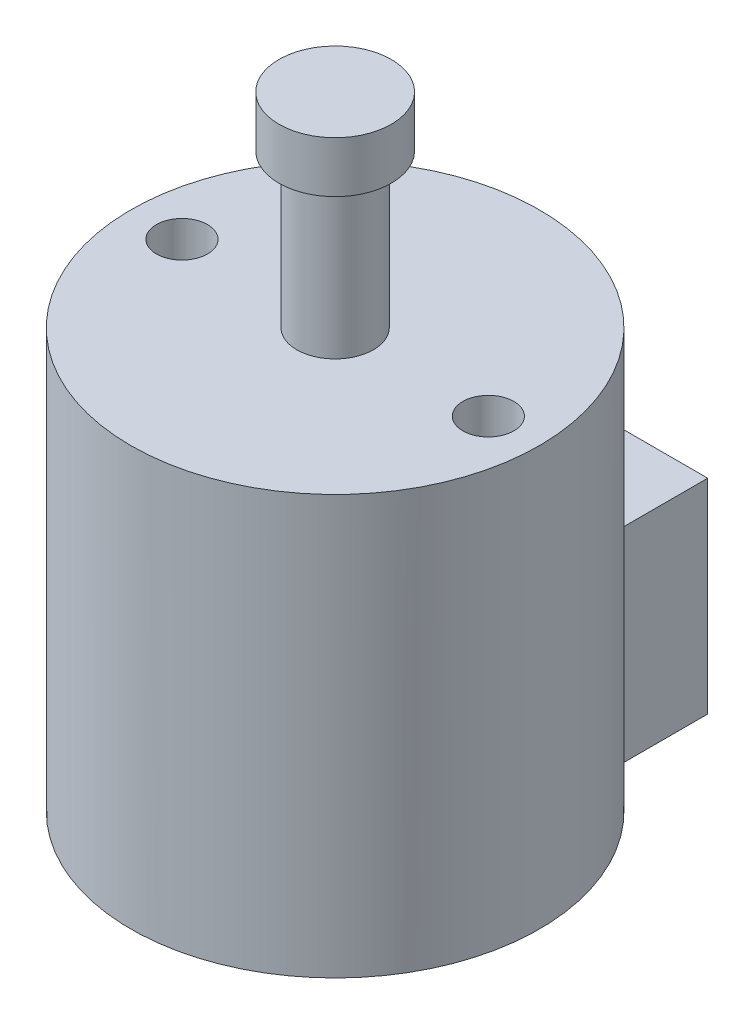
from build123d import *

# Parameters (mm, degrees)
SKETCH1_R           = 4
BOSS_EXTRUDE1_DEPTH = 8.2
SKETCH2_W           = 4
SKETCH2_H           = 5.296379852
BOSS_EXTRUDE2_DEPTH = 4
SKETCH3_W           = 0.665952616
SKETCH3_H           = 0.665952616
BOSS_EXTRUDE3_DEPTH = 0.254
FILLET1_R           = 0.2
SKETCH4_R           = 0.75
BOSS_EXTRUDE4_DEPTH = 4
SKETCH5_R           = 1.1
BOSS_EXTRUDE5_DEPTH = 1
SKETCH6_R           = 0.5
CUT_EXTRUDE1_DEPTH  = 2


with BuildPart() as part:
    # Sketch1 → Boss-Extrude1 (new body)
    with BuildSketch(Plane(origin=(0, 0, 0), x_dir=(1, 0, 0), z_dir=(0, 1, 0))):
        with Locations(Location((0, 0, 0), (0, 0, 270))):
            Circle(SKETCH1_R)
    extrude(amount=BOSS_EXTRUDE1_DEPTH)

    # Sketch2 → Boss-Extrude2 (add)
    with BuildSketch(Plane(origin=(0, 0, 0), x_dir=(1, 0, 0), z_dir=(0, 1, 0))):
        with Locations((0, 2.648189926)):
            Rectangle(SKETCH2_W, SKETCH2_H)
    extrude(amount=BOSS_EXTRUDE2_DEPTH)

    # Sketch3 → Boss-Extrude3 (add)
    with BuildSketch(Plane(origin=(0, 0, -5.296379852), x_dir=(-1, 0, 0), z_dir=(0, 0, -1))):
        with Locations((-0.507976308, 1.835206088)):
            Rectangle(SKETCH3_W, SKETCH3_H)
        with Locations((1.523928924, 1.835206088)):
            Rectangle(SKETCH3_W, SKETCH3_H)
        with Locations((0.507976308, 1.835206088)):
            Rectangle(SKETCH3_W, SKETCH3_H)
        with Locations((-1.523928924, 1.835206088)):
            Rectangle(SKETCH3_W, SKETCH3_H)
    extrude(amount=BOSS_EXTRUDE3_DEPTH)

    # Fillet1
    fillet1_edges = [part.edges().sort_by_distance(p)[0] for p in [
        (-1.856905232, 1.835206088, -5.550379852),
        (-1.523928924, 2.168182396, -5.550379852),
        (-1.190952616, 1.835206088, -5.550379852),
        (-1.523928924, 1.50222978, -5.550379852),
        (-0.840952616, 1.835206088, -5.550379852),
        (-0.507976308, 2.168182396, -5.550379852),
        (-0.175, 1.835206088, -5.550379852),
        (-0.507976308, 1.50222978, -5.550379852),
        (0.507976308, 2.168182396, -5.550379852),
        (0.840952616, 1.835206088, -5.550379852),
        (0.507976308, 1.50222978, -5.550379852),
        (0.175, 1.835206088, -5.550379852),
        (1.523928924, 2.168182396, -5.550379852),
        (1.856905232, 1.835206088, -5.550379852),
        (1.523928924, 1.50222978, -5.550379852),
        (1.190952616, 1.835206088, -5.550379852),
    ]]
    fillet(fillet1_edges, radius=FILLET1_R)

    # Sketch4 → Boss-Extrude4 (add)
    with BuildSketch(Plane(origin=(0, 8.2, 0), x_dir=(1, 0, 0), z_dir=(0, 1, 0))):
        with Locations(Location((0, 0, 0), (0, 0, 270))):
            Circle(SKETCH4_R)
    extrude(amount=BOSS_EXTRUDE4_DEPTH)

    # Sketch5 → Boss-Extrude5 (add)
    with BuildSketch(Plane(origin=(0, 12.2, 0), x_dir=(1, 0, 0), z_dir=(0, 1, 0))):
        with Locations(Location((0, 0, 0), (0, 0, 270))):
            Circle(SKETCH5_R)
    extrude(amount=-BOSS_EXTRUDE5_DEPTH)

    # Sketch6 → Cut-Extrude1 (cut)
    with BuildSketch(Plane(origin=(0, 8.2, 0), x_dir=(1, 0, 0), z_dir=(0, 1, 0))):
        with Locations(Location((3, 0, 0), (0, 0, 270))):
            Circle(SKETCH6_R)
        with Locations(Location((-3, 0, 0), (0, 0, 270))):
            Circle(SKETCH6_R)
    extrude(amount=-CUT_EXTRUDE1_DEPTH, mode=Mode.SUBTRACT)


solid = part.part
